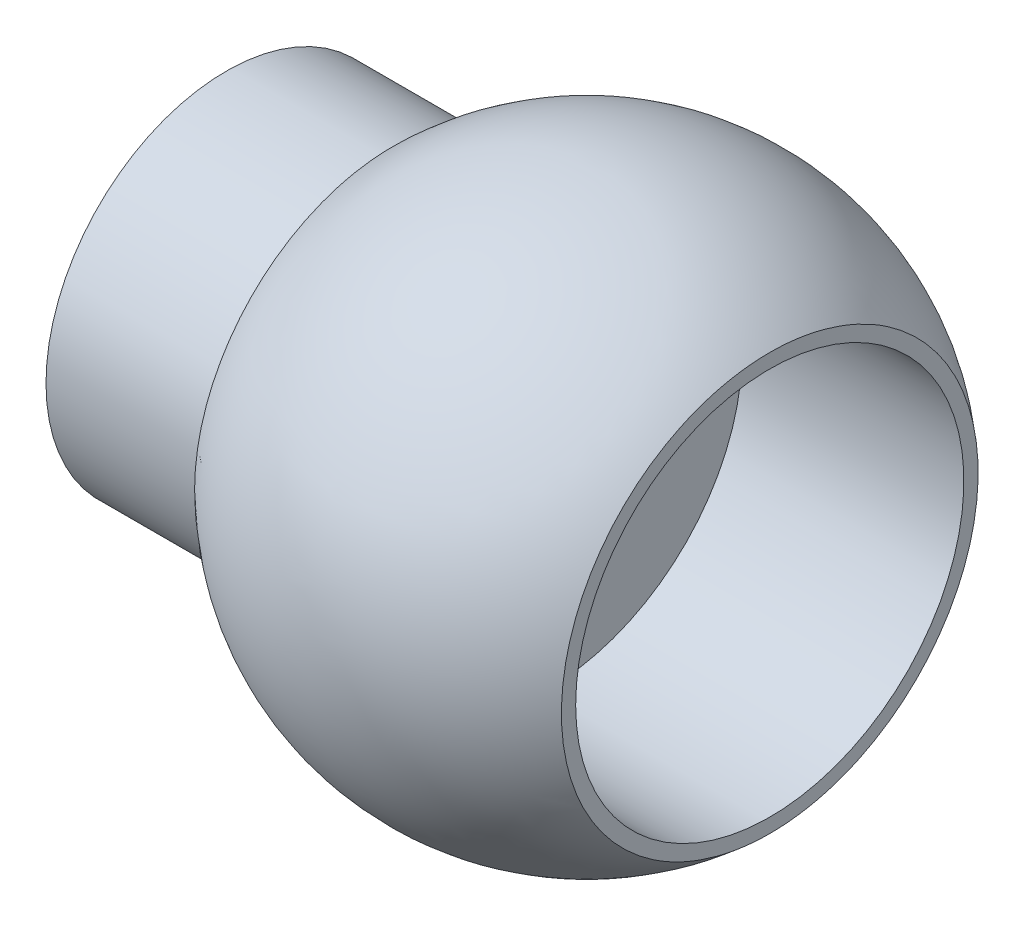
ISO-10303-21;
HEADER;
FILE_DESCRIPTION(('STEP AP214'),'2;1');
FILE_NAME('part.step','',(''),(''),'','','');
FILE_SCHEMA(('AUTOMOTIVE_DESIGN { 1 0 10303 214 1 1 1 1 }'));
ENDSEC;
DATA;
#1=APPLICATION_CONTEXT('core data for automotive mechanical design processes');
#2=APPLICATION_PROTOCOL_DEFINITION('international standard','automotive_design',2000,#1);
#3=PRODUCT_CONTEXT('',#1,'mechanical');
#4=PRODUCT('Part','Part','',(#3));
#5=PRODUCT_RELATED_PRODUCT_CATEGORY('part','',(#4));
#6=PRODUCT_DEFINITION_FORMATION('','',#4);
#7=PRODUCT_DEFINITION_CONTEXT('part definition',#1,'design');
#8=PRODUCT_DEFINITION('design','',#6,#7);
#9=PRODUCT_DEFINITION_SHAPE('','',#8);
#10=(LENGTH_UNIT() NAMED_UNIT(*) SI_UNIT(.MILLI.,.METRE.));
#11=(NAMED_UNIT(*) PLANE_ANGLE_UNIT() SI_UNIT($,.RADIAN.));
#12=(NAMED_UNIT(*) SI_UNIT($,.STERADIAN.) SOLID_ANGLE_UNIT());
#13=UNCERTAINTY_MEASURE_WITH_UNIT(LENGTH_MEASURE(1.E-05),#10,'distance_accuracy_value','');
#14=(GEOMETRIC_REPRESENTATION_CONTEXT(3) GLOBAL_UNCERTAINTY_ASSIGNED_CONTEXT((#13)) GLOBAL_UNIT_ASSIGNED_CONTEXT((#10,
#11,#12)) REPRESENTATION_CONTEXT('',''));
#15=CARTESIAN_POINT('',(0.,0.,0.));
#16=DIRECTION('',(0.,0.,1.));
#17=DIRECTION('',(1.,0.,0.));
#18=AXIS2_PLACEMENT_3D('',#15,#16,#17);
#19=CARTESIAN_POINT('',(-7.48,0.,0.));
#20=DIRECTION('',(-1.,0.,0.));
#21=DIRECTION('',(0.,0.,1.));
#22=AXIS2_PLACEMENT_3D('',#19,#20,#21);
#23=CYLINDRICAL_SURFACE('',#22,2.);
#24=CARTESIAN_POINT('',(-6.5,0.,0.));
#25=DIRECTION('',(-1.,0.,0.));
#26=DIRECTION('',(0.,0.,1.));
#27=AXIS2_PLACEMENT_3D('',#24,#25,#26);
#28=CIRCLE('',#27,2.);
#29=CARTESIAN_POINT('',(-6.5,0.,2.));
#30=VERTEX_POINT('',#29);
#31=EDGE_CURVE('E85',#30,#30,#28,.F.);
#32=ORIENTED_EDGE('',*,*,#31,.F.);
#33=EDGE_LOOP('',(#32));
#34=FACE_BOUND('',#33,.T.);
#35=CARTESIAN_POINT('',(-0.7,0.,0.));
#36=DIRECTION('',(-1.,0.,0.));
#37=DIRECTION('',(0.,0.,1.));
#38=AXIS2_PLACEMENT_3D('',#35,#36,#37);
#39=CIRCLE('',#38,2.);
#40=CARTESIAN_POINT('',(-0.7,0.,2.));
#41=VERTEX_POINT('',#40);
#42=EDGE_CURVE('E22',#41,#41,#39,.F.);
#43=ORIENTED_EDGE('',*,*,#42,.T.);
#44=EDGE_LOOP('',(#43));
#45=FACE_BOUND('',#44,.T.);
#46=ADVANCED_FACE('F16',(#34,#45),#23,.F.);
#47=CARTESIAN_POINT('',(-0.7,0.,0.));
#48=DIRECTION('',(-1.,0.,0.));
#49=DIRECTION('',(0.,0.,1.));
#50=AXIS2_PLACEMENT_3D('',#47,#48,#49);
#51=PLANE('',#50);
#52=ORIENTED_EDGE('',*,*,#42,.F.);
#53=EDGE_LOOP('',(#52));
#54=FACE_BOUND('',#53,.T.);
#55=CARTESIAN_POINT('',(-0.7,0.,0.));
#56=DIRECTION('',(-1.,0.,0.));
#57=DIRECTION('',(0.,0.,1.));
#58=AXIS2_PLACEMENT_3D('',#55,#56,#57);
#59=CIRCLE('',#58,3.5);
#60=CARTESIAN_POINT('',(-0.7,0.,3.5));
#61=VERTEX_POINT('',#60);
#62=EDGE_CURVE('E81',#61,#61,#59,.F.);
#63=ORIENTED_EDGE('',*,*,#62,.T.);
#64=EDGE_LOOP('',(#63));
#65=FACE_BOUND('',#64,.T.);
#66=ADVANCED_FACE('F94',(#54,#65),#51,.F.);
#67=CARTESIAN_POINT('',(-6.5,0.,0.));
#68=DIRECTION('',(-1.,0.,0.));
#69=DIRECTION('',(0.,0.,1.));
#70=AXIS2_PLACEMENT_3D('',#67,#68,#69);
#71=PLANE('',#70);
#72=ORIENTED_EDGE('',*,*,#31,.T.);
#73=EDGE_LOOP('',(#72));
#74=FACE_BOUND('',#73,.T.);
#75=CARTESIAN_POINT('',(-6.5,0.,0.));
#76=DIRECTION('',(-1.,0.,0.));
#77=DIRECTION('',(0.,0.,1.));
#78=AXIS2_PLACEMENT_3D('',#75,#76,#77);
#79=CIRCLE('',#78,3.25);
#80=CARTESIAN_POINT('',(-6.5,0.,3.25));
#81=VERTEX_POINT('',#80);
#82=EDGE_CURVE('E79',#81,#81,#79,.F.);
#83=ORIENTED_EDGE('',*,*,#82,.F.);
#84=EDGE_LOOP('',(#83));
#85=FACE_BOUND('',#84,.T.);
#86=ADVANCED_FACE('F75',(#74,#85),#71,.T.);
#87=CARTESIAN_POINT('',(3.3,0.,0.));
#88=DIRECTION('',(-1.,0.,0.));
#89=DIRECTION('',(0.,0.,1.));
#90=AXIS2_PLACEMENT_3D('',#87,#88,#89);
#91=CYLINDRICAL_SURFACE('',#90,3.5);
#92=ORIENTED_EDGE('',*,*,#62,.F.);
#93=EDGE_LOOP('',(#92));
#94=FACE_BOUND('',#93,.T.);
#95=CARTESIAN_POINT('',(3.3,0.,0.));
#96=DIRECTION('',(-1.,0.,0.));
#97=DIRECTION('',(0.,0.,1.));
#98=AXIS2_PLACEMENT_3D('',#95,#96,#97);
#99=CIRCLE('',#98,3.5);
#100=CARTESIAN_POINT('',(3.3,0.,3.5));
#101=VERTEX_POINT('',#100);
#102=EDGE_CURVE('E44',#101,#101,#99,.F.);
#103=ORIENTED_EDGE('',*,*,#102,.T.);
#104=EDGE_LOOP('',(#103));
#105=FACE_BOUND('',#104,.T.);
#106=ADVANCED_FACE('F70',(#94,#105),#91,.F.);
#107=CARTESIAN_POINT('',(-6.99,0.,0.));
#108=DIRECTION('',(-1.,0.,0.));
#109=DIRECTION('',(0.,0.,1.));
#110=AXIS2_PLACEMENT_3D('',#107,#108,#109);
#111=CYLINDRICAL_SURFACE('',#110,3.25);
#112=ORIENTED_EDGE('',*,*,#82,.T.);
#113=EDGE_LOOP('',(#112));
#114=FACE_BOUND('',#113,.T.);
#115=CARTESIAN_POINT('',(-3.5,0.,0.));
#116=DIRECTION('',(-1.,0.,0.));
#117=DIRECTION('',(0.,0.,1.));
#118=AXIS2_PLACEMENT_3D('',#115,#116,#117);
#119=CIRCLE('',#118,3.25);
#120=CARTESIAN_POINT('',(-3.5,0.,3.25));
#121=VERTEX_POINT('',#120);
#122=EDGE_CURVE('E41',#121,#121,#119,.F.);
#123=ORIENTED_EDGE('',*,*,#122,.F.);
#124=EDGE_LOOP('',(#123));
#125=FACE_BOUND('',#124,.T.);
#126=ADVANCED_FACE('F56',(#114,#125),#111,.T.);
#127=CARTESIAN_POINT('',(3.3,0.,0.));
#128=DIRECTION('',(-1.,0.,0.));
#129=DIRECTION('',(0.,0.,1.));
#130=AXIS2_PLACEMENT_3D('',#127,#128,#129);
#131=PLANE('',#130);
#132=ORIENTED_EDGE('',*,*,#102,.F.);
#133=EDGE_LOOP('',(#132));
#134=FACE_BOUND('',#133,.T.);
#135=CARTESIAN_POINT('',(3.3,3.75632799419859,0.));
#136=CARTESIAN_POINT('',(3.3,3.75632736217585,-0.105465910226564));
#137=CARTESIAN_POINT('',(3.3,3.751882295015,-0.210951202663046));
#138=CARTESIAN_POINT('',(3.3,3.73413092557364,-0.421192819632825));
#139=CARTESIAN_POINT('',(3.3,3.72082200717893,-0.525948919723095));
#140=CARTESIAN_POINT('',(3.3,3.68540281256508,-0.734143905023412));
#141=CARTESIAN_POINT('',(3.3,3.66327856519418,-0.837580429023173));
#142=CARTESIAN_POINT('',(3.3,3.61038121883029,-1.04227950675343));
#143=CARTESIAN_POINT('',(3.3,3.57960110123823,-1.14354022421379));
#144=CARTESIAN_POINT('',(3.3,3.47470249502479,-1.44254039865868));
#145=CARTESIAN_POINT('',(3.3,3.38793959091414,-1.63600106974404));
#146=CARTESIAN_POINT('',(3.3,3.18311997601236,-2.00558871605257));
#147=CARTESIAN_POINT('',(3.3,3.0650620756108,-2.18171503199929));
#148=CARTESIAN_POINT('',(3.3,2.86719169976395,-2.42907713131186));
#149=CARTESIAN_POINT('',(3.3,2.79771874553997,-2.50877319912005));
#150=CARTESIAN_POINT('',(3.3,2.65236084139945,-2.66197457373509));
#151=CARTESIAN_POINT('',(3.3,2.57648213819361,-2.73548577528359));
#152=CARTESIAN_POINT('',(3.3,2.41876539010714,-2.87588679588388));
#153=CARTESIAN_POINT('',(3.3,2.33692466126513,-2.94277360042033));
#154=CARTESIAN_POINT('',(3.3,2.16790689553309,-3.06942172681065));
#155=CARTESIAN_POINT('',(3.3,2.080728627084,-3.12918139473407));
#156=CARTESIAN_POINT('',(3.30000000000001,1.81213809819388,-3.29706283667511));
#157=CARTESIAN_POINT('',(3.30000000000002,1.62350343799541,-3.39393515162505));
#158=CARTESIAN_POINT('',(3.29999999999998,1.23274971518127,-3.55457676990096));
#159=CARTESIAN_POINT('',(3.29999999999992,1.03063079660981,-3.6183464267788));
#160=CARTESIAN_POINT('',(3.29999999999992,0.618529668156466,-3.71106485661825));
#161=CARTESIAN_POINT('',(3.29999999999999,0.408547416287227,-3.74001344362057));
#162=CARTESIAN_POINT('',(3.30000000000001,-0.0132964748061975,-3.76223799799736));
#163=CARTESIAN_POINT('',(3.29999999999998,-0.225158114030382,-3.75551396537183));
#164=CARTESIAN_POINT('',(3.29999999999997,-0.644720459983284,-3.706611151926));
#165=CARTESIAN_POINT('',(3.3,-0.852421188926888,-3.66443256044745));
#166=CARTESIAN_POINT('',(3.3,-1.2578914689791,-3.5457394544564));
#167=CARTESIAN_POINT('',(3.29999999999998,-1.45566091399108,-3.46922457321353));
#168=CARTESIAN_POINT('',(3.29999999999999,-1.74040502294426,-3.33049518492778));
#169=CARTESIAN_POINT('',(3.3,-1.83338004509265,-3.28022676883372));
#170=CARTESIAN_POINT('',(3.3,-2.01476994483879,-3.17203962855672));
#171=CARTESIAN_POINT('',(3.3,-2.10318587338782,-3.11412267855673));
#172=CARTESIAN_POINT('',(3.3,-2.27478242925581,-2.99107130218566));
#173=CARTESIAN_POINT('',(3.3,-2.35796540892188,-2.92594015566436));
#174=CARTESIAN_POINT('',(3.3,-2.51861656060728,-2.78886065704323));
#175=CARTESIAN_POINT('',(3.29999999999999,-2.59607913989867,-2.7169057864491));
#176=CARTESIAN_POINT('',(3.29999999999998,-2.81884618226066,-2.49170467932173));
#177=CARTESIAN_POINT('',(3.29999999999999,-2.95475734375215,-2.32895854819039));
#178=CARTESIAN_POINT('',(3.30000000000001,-3.19727824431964,-1.98293872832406));
#179=CARTESIAN_POINT('',(3.3,-3.30388909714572,-1.79966582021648));
#180=CARTESIAN_POINT('',(3.3,-3.43962502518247,-1.51334331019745));
#181=CARTESIAN_POINT('',(3.3,-3.48087491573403,-1.41587744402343));
#182=CARTESIAN_POINT('',(3.3,-3.55498858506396,-1.21786985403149));
#183=CARTESIAN_POINT('',(3.3,-3.58785915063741,-1.11733069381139));
#184=CARTESIAN_POINT('',(3.3,-3.64495876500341,-0.914009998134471));
#185=CARTESIAN_POINT('',(3.3,-3.66920145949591,-0.811232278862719));
#186=CARTESIAN_POINT('',(3.3,-3.70894610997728,-0.604019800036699));
#187=CARTESIAN_POINT('',(3.3,-3.724450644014,-0.499585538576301));
#188=CARTESIAN_POINT('',(3.3,-3.74245939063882,-0.329157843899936));
#189=CARTESIAN_POINT('',(3.3,-3.74765847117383,-0.263437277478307));
#190=CARTESIAN_POINT('',(3.3,-3.75459297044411,-0.131813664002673));
#191=CARTESIAN_POINT('',(3.3,-3.75632838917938,-0.0659106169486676));
#192=CARTESIAN_POINT('',(3.3,-3.75632736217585,0.105465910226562));
#193=CARTESIAN_POINT('',(3.3,-3.751882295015,0.210951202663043));
#194=CARTESIAN_POINT('',(3.3,-3.73413092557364,0.421192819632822));
#195=CARTESIAN_POINT('',(3.3,-3.72082200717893,0.525948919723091));
#196=CARTESIAN_POINT('',(3.3,-3.68540281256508,0.734143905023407));
#197=CARTESIAN_POINT('',(3.3,-3.66327856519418,0.837580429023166));
#198=CARTESIAN_POINT('',(3.3,-3.6103812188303,1.04227950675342));
#199=CARTESIAN_POINT('',(3.29999999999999,-3.57960110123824,1.14354022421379));
#200=CARTESIAN_POINT('',(3.29999999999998,-3.4747024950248,1.44254039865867));
#201=CARTESIAN_POINT('',(3.3,-3.38793959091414,1.63600106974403));
#202=CARTESIAN_POINT('',(3.3,-3.18311997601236,2.00558871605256));
#203=CARTESIAN_POINT('',(3.29999999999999,-3.06506207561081,2.18171503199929));
#204=CARTESIAN_POINT('',(3.29999999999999,-2.86719169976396,2.42907713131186));
#205=CARTESIAN_POINT('',(3.3,-2.79771874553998,2.50877319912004));
#206=CARTESIAN_POINT('',(3.3,-2.65236084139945,2.66197457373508));
#207=CARTESIAN_POINT('',(3.3,-2.57648213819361,2.73548577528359));
#208=CARTESIAN_POINT('',(3.3,-2.41876539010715,2.87588679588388));
#209=CARTESIAN_POINT('',(3.3,-2.33692466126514,2.94277360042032));
#210=CARTESIAN_POINT('',(3.3,-2.1679068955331,3.06942172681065));
#211=CARTESIAN_POINT('',(3.3,-2.080728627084,3.12918139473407));
#212=CARTESIAN_POINT('',(3.29999999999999,-1.81213809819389,3.29706283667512));
#213=CARTESIAN_POINT('',(3.3,-1.62350343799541,3.39393515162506));
#214=CARTESIAN_POINT('',(3.3,-1.23274971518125,3.55457676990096));
#215=CARTESIAN_POINT('',(3.3,-1.03063079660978,3.61834642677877));
#216=CARTESIAN_POINT('',(3.3,-0.61852966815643,3.71106485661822));
#217=CARTESIAN_POINT('',(3.3,-0.408547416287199,3.74001344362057));
#218=CARTESIAN_POINT('',(3.3,0.0132964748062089,3.76223799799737));
#219=CARTESIAN_POINT('',(3.3,0.225158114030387,3.75551396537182));
#220=CARTESIAN_POINT('',(3.3,0.644720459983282,3.70661115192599));
#221=CARTESIAN_POINT('',(3.3,0.852421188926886,3.66443256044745));
#222=CARTESIAN_POINT('',(3.3,1.25789146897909,3.5457394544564));
#223=CARTESIAN_POINT('',(3.3,1.45566091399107,3.46922457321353));
#224=CARTESIAN_POINT('',(3.3,1.74040502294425,3.33049518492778));
#225=CARTESIAN_POINT('',(3.3,1.83338004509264,3.28022676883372));
#226=CARTESIAN_POINT('',(3.3,2.01476994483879,3.17203962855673));
#227=CARTESIAN_POINT('',(3.3,2.10318587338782,3.11412267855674));
#228=CARTESIAN_POINT('',(3.3,2.27478242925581,2.99107130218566));
#229=CARTESIAN_POINT('',(3.3,2.35796540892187,2.92594015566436));
#230=CARTESIAN_POINT('',(3.3,2.51861656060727,2.78886065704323));
#231=CARTESIAN_POINT('',(3.3,2.59607913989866,2.7169057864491));
#232=CARTESIAN_POINT('',(3.3,2.81884618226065,2.49170467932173));
#233=CARTESIAN_POINT('',(3.3,2.95475734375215,2.32895854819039));
#234=CARTESIAN_POINT('',(3.3,3.19727824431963,1.98293872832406));
#235=CARTESIAN_POINT('',(3.3,3.30388909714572,1.79966582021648));
#236=CARTESIAN_POINT('',(3.3,3.43962502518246,1.51334331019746));
#237=CARTESIAN_POINT('',(3.3,3.48087491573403,1.41587744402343));
#238=CARTESIAN_POINT('',(3.3,3.55498858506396,1.2178698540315));
#239=CARTESIAN_POINT('',(3.3,3.58785915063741,1.1173306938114));
#240=CARTESIAN_POINT('',(3.3,3.64495876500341,0.914009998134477));
#241=CARTESIAN_POINT('',(3.3,3.6692014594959,0.811232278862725));
#242=CARTESIAN_POINT('',(3.3,3.70894610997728,0.604019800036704));
#243=CARTESIAN_POINT('',(3.3,3.724450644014,0.499585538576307));
#244=CARTESIAN_POINT('',(3.3,3.74245939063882,0.329157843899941));
#245=CARTESIAN_POINT('',(3.3,3.74765847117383,0.263437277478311));
#246=CARTESIAN_POINT('',(3.3,3.75459297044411,0.131813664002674));
#247=CARTESIAN_POINT('',(3.3,3.75632838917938,0.0659106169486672));
#248=CARTESIAN_POINT('',(3.3,3.75632799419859,0.));
#249=B_SPLINE_CURVE_WITH_KNOTS('',3,(#135,#136,#137,#138,#139,#140,#141,#142,#143,#144,#145,
#146,#147,#148,#149,#150,#151,#152,#153,#154,#155,#156,#157,#158,#159,#160,#161,#162,#163,#164,
#165,#166,#167,#168,#169,#170,#171,#172,#173,#174,#175,#176,#177,#178,#179,#180,#181,#182,#183,
#184,#185,#186,#187,#188,#189,#190,#191,#192,#193,#194,#195,#196,#197,#198,#199,#200,#201,#202,
#203,#204,#205,#206,#207,#208,#209,#210,#211,#212,#213,#214,#215,#216,#217,#218,#219,#220,#221,
#222,#223,#224,#225,#226,#227,#228,#229,#230,#231,#232,#233,#234,#235,#236,#237,#238,#239,#240,
#241,#242,#243,#244,#245,#246,#247,#248),.UNSPECIFIED.,.T.,.F.,(4,2,2,2,2,2,2,2,2,2,2,2,2,2,2,2,
2,2,2,2,2,2,2,2,2,2,2,2,2,2,2,2,2,2,2,2,2,2,2,2,2,2,2,2,2,2,2,2,2,2,2,2,2,2,2,2,4),(0.,
0.316337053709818,0.632767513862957,0.949701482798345,1.26689318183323,1.89976456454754,
2.53266000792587,2.84952239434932,3.16607927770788,3.48277955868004,3.79955319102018,
4.43243998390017,5.06532001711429,5.69820343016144,6.3310868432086,6.96396687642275,
7.59685366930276,7.9136273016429,8.23032758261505,8.54688446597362,8.86374685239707,
9.49664229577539,10.1295136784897,10.4467053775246,10.76363934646,11.0800698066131,
11.3964068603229,11.5941007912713,11.7917947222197,12.1081317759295,12.4245622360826,
12.741496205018,13.0586879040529,13.6915592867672,14.3244547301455,14.641317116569,
14.9578739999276,15.2745742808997,15.5913479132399,16.2242347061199,16.857114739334,
17.4899981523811,18.1228815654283,18.7557615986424,19.3886483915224,19.7054220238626,
20.0221223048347,20.3386791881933,20.6555415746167,21.2884370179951,21.9213084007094,
22.2385000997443,22.5554340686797,22.8718645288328,23.1882015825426,23.385895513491,
23.5835894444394),.UNSPECIFIED.);
#250=CARTESIAN_POINT('',(3.3,3.75632799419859,0.));
#251=VERTEX_POINT('',#250);
#252=EDGE_CURVE('E28',#251,#251,#249,.T.);
#253=ORIENTED_EDGE('',*,*,#252,.F.);
#254=EDGE_LOOP('',(#253));
#255=FACE_BOUND('',#254,.T.);
#256=ADVANCED_FACE('F52',(#134,#255),#131,.F.);
#257=CARTESIAN_POINT('',(-3.5,0.,0.));
#258=DIRECTION('',(-1.,0.,0.));
#259=DIRECTION('',(0.,0.,1.));
#260=AXIS2_PLACEMENT_3D('',#257,#258,#259);
#261=PLANE('',#260);
#262=ORIENTED_EDGE('',*,*,#122,.T.);
#263=EDGE_LOOP('',(#262));
#264=FACE_BOUND('',#263,.T.);
#265=CARTESIAN_POINT('',(-3.5,-3.57071421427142,0.));
#266=CARTESIAN_POINT('',(-3.5,-3.57071361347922,-0.100254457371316));
#267=CARTESIAN_POINT('',(-3.5,-3.56648819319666,-0.200527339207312));
#268=CARTESIAN_POINT('',(-3.5,-3.54961398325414,-0.400380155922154));
#269=CARTESIAN_POINT('',(-3.5,-3.53696270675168,-0.499959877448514));
#270=CARTESIAN_POINT('',(-3.5,-3.50329370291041,-0.697867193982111));
#271=CARTESIAN_POINT('',(-3.5,-3.4822626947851,-0.796192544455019));
#272=CARTESIAN_POINT('',(-3.5,-3.43197919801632,-0.990776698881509));
#273=CARTESIAN_POINT('',(-3.5,-3.40272003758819,-1.08703375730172));
#274=CARTESIAN_POINT('',(-3.5,-3.30300485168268,-1.37125924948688));
#275=CARTESIAN_POINT('',(-3.5,-3.2205292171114,-1.55516032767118));
#276=CARTESIAN_POINT('',(-3.5,-3.02583048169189,-1.90648530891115));
#277=CARTESIAN_POINT('',(-3.5,-2.91360625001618,-2.0739085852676));
#278=CARTESIAN_POINT('',(-3.5,-2.72551336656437,-2.30904762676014));
#279=CARTESIAN_POINT('',(-3.5,-2.6594733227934,-2.38480562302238));
#280=CARTESIAN_POINT('',(-3.5,-2.52129807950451,-2.53043676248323));
#281=CARTESIAN_POINT('',(-3.5,-2.44916881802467,-2.60031550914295));
#282=CARTESIAN_POINT('',(-3.5,-2.2992454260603,-2.73377880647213));
#283=CARTESIAN_POINT('',(-3.5,-2.22144874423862,-2.79736049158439));
#284=CARTESIAN_POINT('',(-3.5,-2.06078275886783,-2.91775047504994));
#285=CARTESIAN_POINT('',(-3.5,-1.97791228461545,-2.97455720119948));
#286=CARTESIAN_POINT('',(-3.5,-1.72259378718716,-3.13414301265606));
#287=CARTESIAN_POINT('',(-3.50000000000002,-1.54328024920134,-3.22622851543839));
#288=CARTESIAN_POINT('',(-3.49999999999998,-1.17183508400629,-3.37893224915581));
#289=CARTESIAN_POINT('',(-3.49999999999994,-0.979703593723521,-3.4395508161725));
#290=CARTESIAN_POINT('',(-3.49999999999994,-0.587965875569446,-3.52768769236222));
#291=CARTESIAN_POINT('',(-3.49999999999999,-0.388359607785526,-3.55520582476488));
#292=CARTESIAN_POINT('',(-3.50000000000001,0.0126394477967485,-3.57633218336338));
#293=CARTESIAN_POINT('',(-3.49999999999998,0.214032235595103,-3.56994040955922));
#294=CARTESIAN_POINT('',(-3.49999999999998,0.612862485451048,-3.52345406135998));
#295=CARTESIAN_POINT('',(-3.5,0.810299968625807,-3.48335966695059));
#296=CARTESIAN_POINT('',(-3.5,1.19573449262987,-3.37053161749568));
#297=CARTESIAN_POINT('',(-3.49999999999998,1.38373143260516,-3.29779761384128));
#298=CARTESIAN_POINT('',(-3.49999999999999,1.65440530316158,-3.16592334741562));
#299=CARTESIAN_POINT('',(-3.5,1.74278609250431,-3.11813887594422));
#300=CARTESIAN_POINT('',(-3.5,1.91521285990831,-3.01529765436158));
#301=CARTESIAN_POINT('',(-3.5,1.99925983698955,-2.96024259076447));
#302=CARTESIAN_POINT('',(-3.5,2.16237718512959,-2.84327162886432));
#303=CARTESIAN_POINT('',(-3.5,2.24144979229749,-2.7813588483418));
#304=CARTESIAN_POINT('',(-3.5,2.39416258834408,-2.65105294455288));
#305=CARTESIAN_POINT('',(-3.49999999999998,2.46779746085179,-2.58265362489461));
#306=CARTESIAN_POINT('',(-3.49999999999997,2.6795567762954,-2.36858052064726));
#307=CARTESIAN_POINT('',(-3.49999999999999,2.80875207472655,-2.2138762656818));
#308=CARTESIAN_POINT('',(-3.50000000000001,3.03928913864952,-1.88495453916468));
#309=CARTESIAN_POINT('',(-3.5,3.140631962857,-1.71073780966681));
#310=CARTESIAN_POINT('',(-3.5,3.2696606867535,-1.43856353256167));
#311=CARTESIAN_POINT('',(-3.5,3.3088722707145,-1.34591380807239));
#312=CARTESIAN_POINT('',(-3.5,3.3793237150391,-1.15769049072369));
#313=CARTESIAN_POINT('',(-3.5,3.41057002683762,-1.06211933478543));
#314=CARTESIAN_POINT('',(-3.5,3.46484814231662,-0.868845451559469));
#315=CARTESIAN_POINT('',(-3.5,3.48789291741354,-0.77114635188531));
#316=CARTESIAN_POINT('',(-3.5,3.52567364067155,-0.574172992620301));
#317=CARTESIAN_POINT('',(-3.5,3.54041203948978,-0.4748992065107));
#318=CARTESIAN_POINT('',(-3.5,3.55753090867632,-0.312892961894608));
#319=CARTESIAN_POINT('',(-3.5,3.56247308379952,-0.250419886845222));
#320=CARTESIAN_POINT('',(-3.5,3.56906492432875,-0.125300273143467));
#321=CARTESIAN_POINT('',(-3.5,3.57071458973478,-0.0626537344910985));
#322=CARTESIAN_POINT('',(-3.5,3.57071361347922,0.100254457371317));
#323=CARTESIAN_POINT('',(-3.5,3.56648819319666,0.200527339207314));
#324=CARTESIAN_POINT('',(-3.5,3.54961398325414,0.400380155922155));
#325=CARTESIAN_POINT('',(-3.5,3.53696270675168,0.499959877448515));
#326=CARTESIAN_POINT('',(-3.5,3.50329370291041,0.697867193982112));
#327=CARTESIAN_POINT('',(-3.5,3.4822626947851,0.79619254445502));
#328=CARTESIAN_POINT('',(-3.5,3.43197919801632,0.99077669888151));
#329=CARTESIAN_POINT('',(-3.5,3.40272003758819,1.08703375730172));
#330=CARTESIAN_POINT('',(-3.5,3.30300485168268,1.37125924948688));
#331=CARTESIAN_POINT('',(-3.5,3.2205292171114,1.55516032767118));
#332=CARTESIAN_POINT('',(-3.5,3.02583048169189,1.90648530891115));
#333=CARTESIAN_POINT('',(-3.5,2.91360625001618,2.0739085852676));
#334=CARTESIAN_POINT('',(-3.5,2.72551336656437,2.30904762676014));
#335=CARTESIAN_POINT('',(-3.5,2.6594733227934,2.38480562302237));
#336=CARTESIAN_POINT('',(-3.5,2.52129807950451,2.53043676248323));
#337=CARTESIAN_POINT('',(-3.5,2.44916881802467,2.60031550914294));
#338=CARTESIAN_POINT('',(-3.5,2.2992454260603,2.73377880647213));
#339=CARTESIAN_POINT('',(-3.5,2.22144874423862,2.79736049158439));
#340=CARTESIAN_POINT('',(-3.5,2.06078275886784,2.91775047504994));
#341=CARTESIAN_POINT('',(-3.5,1.97791228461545,2.97455720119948));
#342=CARTESIAN_POINT('',(-3.5,1.72259378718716,3.13414301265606));
#343=CARTESIAN_POINT('',(-3.50000000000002,1.54328024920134,3.22622851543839));
#344=CARTESIAN_POINT('',(-3.49999999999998,1.17183508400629,3.37893224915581));
#345=CARTESIAN_POINT('',(-3.49999999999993,0.979703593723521,3.4395508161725));
#346=CARTESIAN_POINT('',(-3.49999999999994,0.587965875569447,3.52768769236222));
#347=CARTESIAN_POINT('',(-3.49999999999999,0.388359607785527,3.55520582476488));
#348=CARTESIAN_POINT('',(-3.50000000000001,-0.012639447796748,3.57633218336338));
#349=CARTESIAN_POINT('',(-3.49999999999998,-0.214032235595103,3.56994040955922));
#350=CARTESIAN_POINT('',(-3.49999999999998,-0.612862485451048,3.52345406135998));
#351=CARTESIAN_POINT('',(-3.5,-0.810299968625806,3.48335966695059));
#352=CARTESIAN_POINT('',(-3.5,-1.19573449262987,3.37053161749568));
#353=CARTESIAN_POINT('',(-3.49999999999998,-1.38373143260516,3.29779761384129));
#354=CARTESIAN_POINT('',(-3.49999999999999,-1.65440530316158,3.16592334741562));
#355=CARTESIAN_POINT('',(-3.5,-1.74278609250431,3.11813887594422));
#356=CARTESIAN_POINT('',(-3.5,-1.91521285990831,3.01529765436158));
#357=CARTESIAN_POINT('',(-3.5,-1.99925983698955,2.96024259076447));
#358=CARTESIAN_POINT('',(-3.5,-2.16237718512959,2.84327162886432));
#359=CARTESIAN_POINT('',(-3.5,-2.24144979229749,2.7813588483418));
#360=CARTESIAN_POINT('',(-3.5,-2.39416258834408,2.65105294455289));
#361=CARTESIAN_POINT('',(-3.49999999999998,-2.46779746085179,2.58265362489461));
#362=CARTESIAN_POINT('',(-3.49999999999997,-2.67955677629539,2.36858052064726));
#363=CARTESIAN_POINT('',(-3.49999999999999,-2.80875207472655,2.2138762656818));
#364=CARTESIAN_POINT('',(-3.50000000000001,-3.03928913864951,1.88495453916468));
#365=CARTESIAN_POINT('',(-3.5,-3.140631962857,1.71073780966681));
#366=CARTESIAN_POINT('',(-3.5,-3.2696606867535,1.43856353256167));
#367=CARTESIAN_POINT('',(-3.5,-3.3088722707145,1.34591380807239));
#368=CARTESIAN_POINT('',(-3.5,-3.3793237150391,1.1576904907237));
#369=CARTESIAN_POINT('',(-3.5,-3.41057002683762,1.06211933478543));
#370=CARTESIAN_POINT('',(-3.5,-3.46484814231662,0.868845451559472));
#371=CARTESIAN_POINT('',(-3.5,-3.48789291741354,0.771146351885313));
#372=CARTESIAN_POINT('',(-3.5,-3.52567364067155,0.574172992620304));
#373=CARTESIAN_POINT('',(-3.5,-3.54041203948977,0.474899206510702));
#374=CARTESIAN_POINT('',(-3.5,-3.55753090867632,0.312892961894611));
#375=CARTESIAN_POINT('',(-3.5,-3.56247308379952,0.250419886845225));
#376=CARTESIAN_POINT('',(-3.5,-3.56906492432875,0.125300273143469));
#377=CARTESIAN_POINT('',(-3.5,-3.57071458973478,0.0626537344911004));
#378=CARTESIAN_POINT('',(-3.5,-3.57071421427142,0.));
#379=B_SPLINE_CURVE_WITH_KNOTS('',3,(#265,#266,#267,#268,#269,#270,#271,#272,#273,#274,#275,
#276,#277,#278,#279,#280,#281,#282,#283,#284,#285,#286,#287,#288,#289,#290,#291,#292,#293,#294,
#295,#296,#297,#298,#299,#300,#301,#302,#303,#304,#305,#306,#307,#308,#309,#310,#311,#312,#313,
#314,#315,#316,#317,#318,#319,#320,#321,#322,#323,#324,#325,#326,#327,#328,#329,#330,#331,#332,
#333,#334,#335,#336,#337,#338,#339,#340,#341,#342,#343,#344,#345,#346,#347,#348,#349,#350,#351,
#352,#353,#354,#355,#356,#357,#358,#359,#360,#361,#362,#363,#364,#365,#366,#367,#368,#369,#370,
#371,#372,#373,#374,#375,#376,#377,#378),.UNSPECIFIED.,.T.,.F.,(4,2,2,2,2,2,2,2,2,2,2,2,2,2,2,2,
2,2,2,2,2,2,2,2,2,2,2,2,2,2,2,2,2,2,2,2,2,2,2,2,2,2,2,2,2,2,2,2,2,2,2,2,2,2,2,2,4),(0.,
0.300705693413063,0.601500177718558,0.90277329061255,1.20429139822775,1.80589031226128,
2.40751209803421,2.70871716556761,3.00963182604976,3.31068279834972,3.61180349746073,
4.21341706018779,4.81502419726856,5.41663454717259,6.01824489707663,6.61985203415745,
7.22146559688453,7.52258629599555,7.8236372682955,8.12455192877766,8.42575699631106,
9.02737878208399,9.62897769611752,9.93049580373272,10.2317689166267,10.5325634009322,
10.8332690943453,11.0211942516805,11.2091194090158,11.5098251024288,11.8106195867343,
12.1118926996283,12.4134108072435,13.015009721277,13.61663150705,13.9178365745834,
14.2187512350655,14.5198022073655,14.8209229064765,15.4225364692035,16.0241436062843,
16.6257539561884,17.2273643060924,17.8289714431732,18.4305850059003,18.7317057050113,
19.0327566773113,19.3336713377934,19.6348764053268,20.2364981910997,20.8380971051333,
21.1396152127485,21.4408883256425,21.741682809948,22.042388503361,22.2303136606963,
22.4182388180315),.UNSPECIFIED.);
#380=CARTESIAN_POINT('',(-3.5,-3.57071421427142,0.));
#381=VERTEX_POINT('',#380);
#382=EDGE_CURVE('E11',#381,#381,#379,.T.);
#383=ORIENTED_EDGE('',*,*,#382,.F.);
#384=EDGE_LOOP('',(#383));
#385=FACE_BOUND('',#384,.T.);
#386=ADVANCED_FACE('F36',(#264,#385),#261,.T.);
#387=CARTESIAN_POINT('',(0.,0.,0.));
#388=DIRECTION('',(0.,-1.,0.));
#389=DIRECTION('',(0.,0.,1.));
#390=AXIS2_PLACEMENT_3D('',#387,#388,#389);
#391=SPHERICAL_SURFACE('',#390,5.);
#392=ORIENTED_EDGE('',*,*,#382,.T.);
#393=EDGE_LOOP('',(#392));
#394=FACE_BOUND('',#393,.T.);
#395=CARTESIAN_POINT('',(0.,5.,0.));
#396=VERTEX_POINT('',#395);
#397=VERTEX_LOOP('',#396);
#398=FACE_BOUND('',#397,.T.);
#399=ORIENTED_EDGE('',*,*,#252,.T.);
#400=EDGE_LOOP('',(#399));
#401=FACE_BOUND('',#400,.T.);
#402=CARTESIAN_POINT('',(0.,-5.,0.));
#403=VERTEX_POINT('',#402);
#404=VERTEX_LOOP('',#403);
#405=FACE_BOUND('',#404,.T.);
#406=ADVANCED_FACE('F18',(#394,#398,#401,#405),#391,.T.);
#407=CLOSED_SHELL('',(#46,#66,#86,#106,#126,#256,#386,#406));
#408=MANIFOLD_SOLID_BREP('B1',#407);
#409=ADVANCED_BREP_SHAPE_REPRESENTATION('',(#18,#408),#14);
#410=SHAPE_DEFINITION_REPRESENTATION(#9,#409);
ENDSEC;
END-ISO-10303-21;
